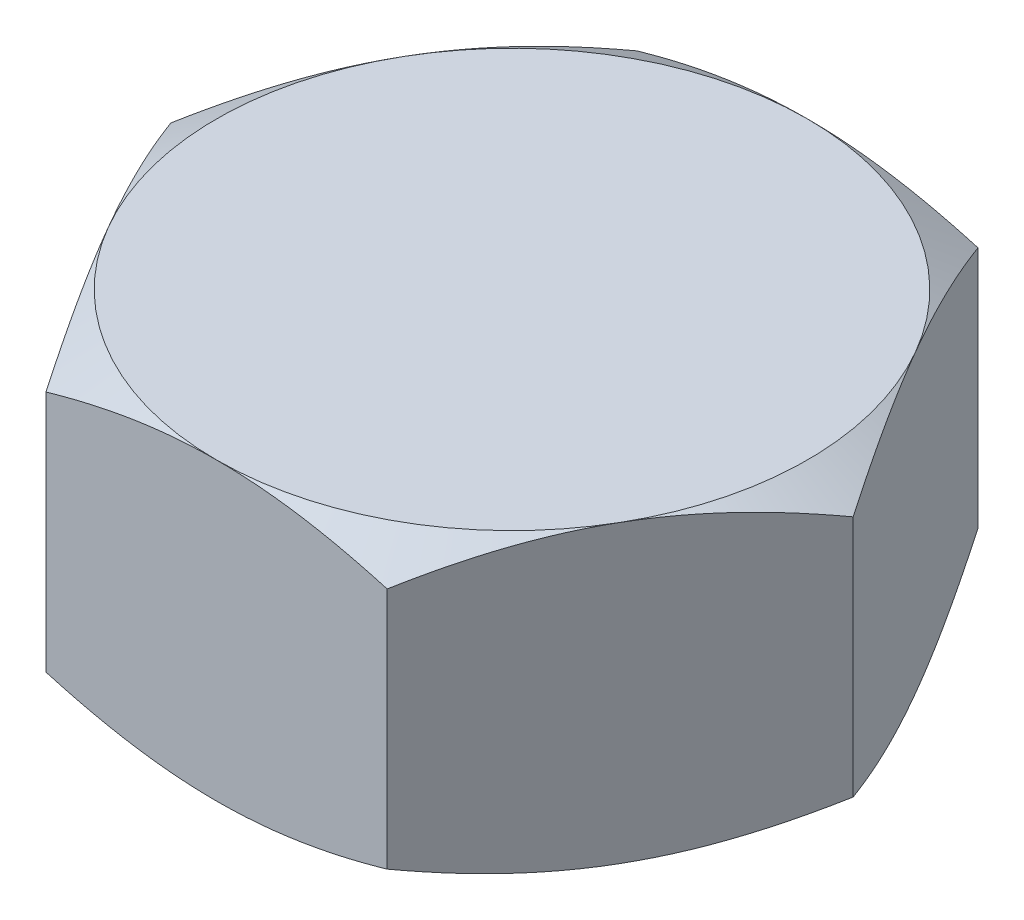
ISO-10303-21;
HEADER;
FILE_DESCRIPTION(('STEP AP214'),'2;1');
FILE_NAME('part.step','',(''),(''),'','','');
FILE_SCHEMA(('AUTOMOTIVE_DESIGN { 1 0 10303 214 1 1 1 1 }'));
ENDSEC;
DATA;
#1=APPLICATION_CONTEXT('core data for automotive mechanical design processes');
#2=APPLICATION_PROTOCOL_DEFINITION('international standard','automotive_design',2000,#1);
#3=PRODUCT_CONTEXT('',#1,'mechanical');
#4=PRODUCT('Part','Part','',(#3));
#5=PRODUCT_RELATED_PRODUCT_CATEGORY('part','',(#4));
#6=PRODUCT_DEFINITION_FORMATION('','',#4);
#7=PRODUCT_DEFINITION_CONTEXT('part definition',#1,'design');
#8=PRODUCT_DEFINITION('design','',#6,#7);
#9=PRODUCT_DEFINITION_SHAPE('','',#8);
#10=(LENGTH_UNIT() NAMED_UNIT(*) SI_UNIT(.MILLI.,.METRE.));
#11=(NAMED_UNIT(*) PLANE_ANGLE_UNIT() SI_UNIT($,.RADIAN.));
#12=(NAMED_UNIT(*) SI_UNIT($,.STERADIAN.) SOLID_ANGLE_UNIT());
#13=UNCERTAINTY_MEASURE_WITH_UNIT(LENGTH_MEASURE(1.E-05),#10,'distance_accuracy_value','');
#14=(GEOMETRIC_REPRESENTATION_CONTEXT(3) GLOBAL_UNCERTAINTY_ASSIGNED_CONTEXT((#13)) GLOBAL_UNIT_ASSIGNED_CONTEXT((#10,
#11,#12)) REPRESENTATION_CONTEXT('',''));
#15=CARTESIAN_POINT('',(0.,0.,0.));
#16=DIRECTION('',(0.,0.,1.));
#17=DIRECTION('',(1.,0.,0.));
#18=AXIS2_PLACEMENT_3D('',#15,#16,#17);
#19=CARTESIAN_POINT('',(2.88675134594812,2.5,5.00000000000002));
#20=DIRECTION('',(-0.866025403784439,0.,-0.499999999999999));
#21=DIRECTION('',(-0.499999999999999,0.,0.866025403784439));
#22=AXIS2_PLACEMENT_3D('',#19,#20,#21);
#23=PLANE('',#22);
#24=CARTESIAN_POINT('',(5.7736181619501,-2.05335134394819,-0.000200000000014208));
#25=CARTESIAN_POINT('',(5.64675433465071,-2.12661343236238,0.219534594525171));
#26=CARTESIAN_POINT('',(5.5188054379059,-2.19324867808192,0.441148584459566));
#27=CARTESIAN_POINT('',(5.26069210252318,-2.3095610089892,0.888213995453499));
#28=CARTESIAN_POINT('',(5.13052307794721,-2.35919695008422,1.11367335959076));
#29=CARTESIAN_POINT('',(4.87177839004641,-2.43644897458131,1.56183230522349));
#30=CARTESIAN_POINT('',(4.74324302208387,-2.46457962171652,1.78446209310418));
#31=CARTESIAN_POINT('',(4.54998783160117,-2.48980507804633,2.11918990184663));
#32=CARTESIAN_POINT('',(4.48552534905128,-2.49538654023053,2.23084219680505));
#33=CARTESIAN_POINT('',(4.35654081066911,-2.50079778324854,2.45424997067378));
#34=CARTESIAN_POINT('',(4.2920187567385,-2.50062774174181,2.5660054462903));
#35=CARTESIAN_POINT('',(4.11524635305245,-2.49224636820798,2.87218423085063));
#36=CARTESIAN_POINT('',(4.00305457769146,-2.47817022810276,3.0665060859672));
#37=CARTESIAN_POINT('',(3.77941563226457,-2.43353474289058,3.4538601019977));
#38=CARTESIAN_POINT('',(3.66796924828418,-2.40296013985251,3.64689090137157));
#39=CARTESIAN_POINT('',(3.44387972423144,-2.32653150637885,4.03502534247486));
#40=CARTESIAN_POINT('',(3.3312648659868,-2.28035362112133,4.23007999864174));
#41=CARTESIAN_POINT('',(3.1077146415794,-2.17554820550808,4.61728034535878));
#42=CARTESIAN_POINT('',(2.99677641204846,-2.11694529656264,4.8094309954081));
#43=CARTESIAN_POINT('',(2.88663587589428,-2.05335134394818,5.00020000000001));
#44=B_SPLINE_CURVE_WITH_KNOTS('',3,(#24,#25,#26,#27,#28,#29,#30,#31,#32,#33,#34,#35,#36,#37,#38,
#39,#40,#41,#42,#43),.UNSPECIFIED.,.F.,.F.,(4,2,2,2,2,2,2,2,2,4),(0.,0.792555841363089,
1.58701660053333,2.3618153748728,2.74884076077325,3.13585419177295,3.8096236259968,
4.4840172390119,5.17336882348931,5.86136694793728),.UNSPECIFIED.);
#45=CARTESIAN_POINT('',(5.77350269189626,-2.05341801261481,0.));
#46=VERTEX_POINT('',#45);
#47=CARTESIAN_POINT('',(4.33012701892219,-2.5,2.5));
#48=VERTEX_POINT('',#47);
#49=EDGE_CURVE('E47',#46,#48,#44,.T.);
#50=ORIENTED_EDGE('',*,*,#49,.F.);
#51=DIRECTION('',(0.,-1.,0.));
#52=VECTOR('',#51,1.);
#53=CARTESIAN_POINT('',(5.77350269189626,2.5,0.));
#54=LINE('',#53,#52);
#55=CARTESIAN_POINT('',(5.77350269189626,2.05341801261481,0.));
#56=VERTEX_POINT('',#55);
#57=EDGE_CURVE('E162',#56,#46,#54,.T.);
#58=ORIENTED_EDGE('',*,*,#57,.F.);
#59=CARTESIAN_POINT('',(2.88663587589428,2.05335134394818,5.00020000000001));
#60=CARTESIAN_POINT('',(3.01349970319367,2.12661343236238,4.78046540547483));
#61=CARTESIAN_POINT('',(3.14144859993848,2.19324867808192,4.55885141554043));
#62=CARTESIAN_POINT('',(3.3995619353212,2.3095610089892,4.1117860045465));
#63=CARTESIAN_POINT('',(3.52973095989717,2.35919695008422,3.88632664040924));
#64=CARTESIAN_POINT('',(3.78847564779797,2.43644897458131,3.4381676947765));
#65=CARTESIAN_POINT('',(3.91701101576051,2.46457962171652,3.21553790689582));
#66=CARTESIAN_POINT('',(4.11026620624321,2.48980507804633,2.88081009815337));
#67=CARTESIAN_POINT('',(4.1747286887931,2.49538654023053,2.76915780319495));
#68=CARTESIAN_POINT('',(4.30371322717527,2.50079778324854,2.54575002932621));
#69=CARTESIAN_POINT('',(4.36823528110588,2.50062774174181,2.4339945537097));
#70=CARTESIAN_POINT('',(4.54500768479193,2.49224636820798,2.12781576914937));
#71=CARTESIAN_POINT('',(4.65719946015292,2.47817022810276,1.93349391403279));
#72=CARTESIAN_POINT('',(4.88083840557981,2.43353474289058,1.5461398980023));
#73=CARTESIAN_POINT('',(4.9922847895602,2.40296013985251,1.35310909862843));
#74=CARTESIAN_POINT('',(5.21637431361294,2.32653150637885,0.964974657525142));
#75=CARTESIAN_POINT('',(5.32898917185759,2.28035362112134,0.769920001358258));
#76=CARTESIAN_POINT('',(5.55253939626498,2.17554820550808,0.382719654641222));
#77=CARTESIAN_POINT('',(5.66347762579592,2.11694529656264,0.190569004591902));
#78=CARTESIAN_POINT('',(5.7736181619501,2.05335134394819,-0.000200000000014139));
#79=B_SPLINE_CURVE_WITH_KNOTS('',3,(#59,#60,#61,#62,#63,#64,#65,#66,#67,#68,#69,#70,#71,#72,#73,
#74,#75,#76,#77,#78),.UNSPECIFIED.,.F.,.F.,(4,2,2,2,2,2,2,2,2,4),(0.,0.792555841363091,
1.58701660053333,2.36181537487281,2.74884076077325,3.13585419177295,3.8096236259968,
4.48401723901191,5.17336882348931,5.86136694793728),.UNSPECIFIED.);
#80=CARTESIAN_POINT('',(4.33012701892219,2.5,2.5));
#81=VERTEX_POINT('',#80);
#82=EDGE_CURVE('E244',#81,#56,#79,.T.);
#83=ORIENTED_EDGE('',*,*,#82,.F.);
#84=CARTESIAN_POINT('',(2.88675134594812,2.05341801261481,5.00000000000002));
#85=VERTEX_POINT('',#84);
#86=EDGE_CURVE('E254',#85,#81,#79,.T.);
#87=ORIENTED_EDGE('',*,*,#86,.F.);
#88=DIRECTION('',(0.,-1.,0.));
#89=VECTOR('',#88,1.);
#90=CARTESIAN_POINT('',(2.88675134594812,2.5,5.00000000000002));
#91=LINE('',#90,#89);
#92=CARTESIAN_POINT('',(2.88675134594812,-2.05341801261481,5.00000000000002));
#93=VERTEX_POINT('',#92);
#94=EDGE_CURVE('E149',#85,#93,#91,.T.);
#95=ORIENTED_EDGE('',*,*,#94,.T.);
#96=EDGE_CURVE('E141',#48,#93,#44,.T.);
#97=ORIENTED_EDGE('',*,*,#96,.F.);
#98=EDGE_LOOP('',(#50,#58,#83,#87,#95,#97));
#99=FACE_BOUND('',#98,.T.);
#100=ADVANCED_FACE('F31',(#99),#23,.F.);
#101=CARTESIAN_POINT('',(5.77350269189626,2.5,0.));
#102=DIRECTION('',(-0.866025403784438,0.,0.5));
#103=DIRECTION('',(0.5,0.,0.866025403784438));
#104=AXIS2_PLACEMENT_3D('',#101,#102,#103);
#105=PLANE('',#104);
#106=CARTESIAN_POINT('',(2.88663587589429,-2.05335134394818,-5.00020000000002));
#107=CARTESIAN_POINT('',(3.01349970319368,-2.12661343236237,-4.78046540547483));
#108=CARTESIAN_POINT('',(3.14144859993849,-2.19324867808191,-4.55885141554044));
#109=CARTESIAN_POINT('',(3.3995619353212,-2.3095610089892,-4.1117860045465));
#110=CARTESIAN_POINT('',(3.52973095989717,-2.35919695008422,-3.88632664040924));
#111=CARTESIAN_POINT('',(3.78847564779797,-2.43644897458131,-3.43816769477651));
#112=CARTESIAN_POINT('',(3.91701101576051,-2.46457962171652,-3.21553790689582));
#113=CARTESIAN_POINT('',(4.11026620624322,-2.48980507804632,-2.88081009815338));
#114=CARTESIAN_POINT('',(4.17472868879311,-2.49538654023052,-2.76915780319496));
#115=CARTESIAN_POINT('',(4.30371322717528,-2.50079778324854,-2.54575002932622));
#116=CARTESIAN_POINT('',(4.36823528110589,-2.5006277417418,-2.4339945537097));
#117=CARTESIAN_POINT('',(4.54500768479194,-2.49224636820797,-2.12781576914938));
#118=CARTESIAN_POINT('',(4.65719946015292,-2.47817022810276,-1.9334939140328));
#119=CARTESIAN_POINT('',(4.88083840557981,-2.43353474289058,-1.54613989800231));
#120=CARTESIAN_POINT('',(4.9922847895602,-2.4029601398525,-1.35310909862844));
#121=CARTESIAN_POINT('',(5.21637431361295,-2.32653150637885,-0.96497465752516));
#122=CARTESIAN_POINT('',(5.32898917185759,-2.28035362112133,-0.769920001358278));
#123=CARTESIAN_POINT('',(5.55253939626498,-2.17554820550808,-0.382719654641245));
#124=CARTESIAN_POINT('',(5.66347762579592,-2.11694529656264,-0.190569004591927));
#125=CARTESIAN_POINT('',(5.7736181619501,-2.05335134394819,0.000199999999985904));
#126=B_SPLINE_CURVE_WITH_KNOTS('',3,(#106,#107,#108,#109,#110,#111,#112,#113,#114,#115,#116,
#117,#118,#119,#120,#121,#122,#123,#124,#125),.UNSPECIFIED.,.F.,.F.,(4,2,2,2,2,2,2,2,2,4),(0.,
0.792555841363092,1.58701660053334,2.36181537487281,2.74884076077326,3.13585419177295,
3.8096236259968,4.4840172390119,5.17336882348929,5.86136694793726),.UNSPECIFIED.);
#127=CARTESIAN_POINT('',(2.88675134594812,-2.05341801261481,-5.00000000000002));
#128=VERTEX_POINT('',#127);
#129=CARTESIAN_POINT('',(4.3301270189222,-2.5,-2.5));
#130=VERTEX_POINT('',#129);
#131=EDGE_CURVE('E54',#128,#130,#126,.T.);
#132=ORIENTED_EDGE('',*,*,#131,.F.);
#133=DIRECTION('',(0.,-1.,0.));
#134=VECTOR('',#133,1.);
#135=CARTESIAN_POINT('',(2.88675134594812,2.5,-5.00000000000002));
#136=LINE('',#135,#134);
#137=CARTESIAN_POINT('',(2.88675134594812,2.05341801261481,-5.00000000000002));
#138=VERTEX_POINT('',#137);
#139=EDGE_CURVE('E159',#138,#128,#136,.T.);
#140=ORIENTED_EDGE('',*,*,#139,.F.);
#141=CARTESIAN_POINT('',(5.7736181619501,2.05335134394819,0.000199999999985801));
#142=CARTESIAN_POINT('',(5.64675433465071,2.12661343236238,-0.219534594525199));
#143=CARTESIAN_POINT('',(5.5188054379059,2.19324867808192,-0.441148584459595));
#144=CARTESIAN_POINT('',(5.26069210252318,2.3095610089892,-0.888213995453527));
#145=CARTESIAN_POINT('',(5.13052307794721,2.35919695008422,-1.11367335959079));
#146=CARTESIAN_POINT('',(4.87177839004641,2.43644897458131,-1.56183230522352));
#147=CARTESIAN_POINT('',(4.74324302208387,2.46457962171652,-1.7844620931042));
#148=CARTESIAN_POINT('',(4.54998783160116,2.48980507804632,-2.11918990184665));
#149=CARTESIAN_POINT('',(4.48552534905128,2.49538654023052,-2.23084219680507));
#150=CARTESIAN_POINT('',(4.35654081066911,2.50079778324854,-2.45424997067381));
#151=CARTESIAN_POINT('',(4.2920187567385,2.5006277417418,-2.56600544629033));
#152=CARTESIAN_POINT('',(4.11524635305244,2.49224636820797,-2.87218423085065));
#153=CARTESIAN_POINT('',(4.00305457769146,2.47817022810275,-3.06650608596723));
#154=CARTESIAN_POINT('',(3.77941563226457,2.43353474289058,-3.45386010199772));
#155=CARTESIAN_POINT('',(3.66796924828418,2.4029601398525,-3.64689090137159));
#156=CARTESIAN_POINT('',(3.44387972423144,2.32653150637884,-4.03502534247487));
#157=CARTESIAN_POINT('',(3.3312648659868,2.28035362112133,-4.23007999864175));
#158=CARTESIAN_POINT('',(3.1077146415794,2.17554820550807,-4.61728034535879));
#159=CARTESIAN_POINT('',(2.99677641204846,2.11694529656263,-4.80943099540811));
#160=CARTESIAN_POINT('',(2.88663587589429,2.05335134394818,-5.00020000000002));
#161=B_SPLINE_CURVE_WITH_KNOTS('',3,(#141,#142,#143,#144,#145,#146,#147,#148,#149,#150,#151,
#152,#153,#154,#155,#156,#157,#158,#159,#160),.UNSPECIFIED.,.F.,.F.,(4,2,2,2,2,2,2,2,2,4),(0.,
0.79255584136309,1.58701660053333,2.3618153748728,2.74884076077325,3.13585419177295,
3.80962362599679,4.48401723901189,5.17336882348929,5.86136694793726),.UNSPECIFIED.);
#162=CARTESIAN_POINT('',(4.3301270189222,2.5,-2.5));
#163=VERTEX_POINT('',#162);
#164=EDGE_CURVE('E253',#163,#138,#161,.T.);
#165=ORIENTED_EDGE('',*,*,#164,.F.);
#166=EDGE_CURVE('E249',#56,#163,#161,.T.);
#167=ORIENTED_EDGE('',*,*,#166,.F.);
#168=ORIENTED_EDGE('',*,*,#57,.T.);
#169=EDGE_CURVE('E266',#130,#46,#126,.T.);
#170=ORIENTED_EDGE('',*,*,#169,.F.);
#171=EDGE_LOOP('',(#132,#140,#165,#167,#168,#170));
#172=FACE_BOUND('',#171,.T.);
#173=ADVANCED_FACE('F255',(#172),#105,.F.);
#174=CARTESIAN_POINT('',(2.88675134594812,2.5,-5.00000000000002));
#175=DIRECTION('',(0.,0.,1.));
#176=DIRECTION('',(1.,0.,0.));
#177=AXIS2_PLACEMENT_3D('',#174,#175,#176);
#178=PLANE('',#177);
#179=CARTESIAN_POINT('',(-7.83582824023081,-0.0201818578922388,-5.00000000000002));
#180=CARTESIAN_POINT('',(-7.61675258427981,-0.126778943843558,-5.00000000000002));
#181=CARTESIAN_POINT('',(-7.39718272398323,-0.232377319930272,-5.00000000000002));
#182=CARTESIAN_POINT('',(-6.9567920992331,-0.441016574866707,-5.00000000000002));
#183=CARTESIAN_POINT('',(-6.73597115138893,-0.544057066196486,-5.00000000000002));
#184=CARTESIAN_POINT('',(-6.29171673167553,-0.74752156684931,-5.00000000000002));
#185=CARTESIAN_POINT('',(-6.06827562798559,-0.84792896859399,-5.00000000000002));
#186=CARTESIAN_POINT('',(-5.61964466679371,-1.04474266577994,-5.00000000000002));
#187=CARTESIAN_POINT('',(-5.39445489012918,-1.14114914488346,-5.00000000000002));
#188=CARTESIAN_POINT('',(-4.93438073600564,-1.33205603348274,-5.00000000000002));
#189=CARTESIAN_POINT('',(-4.69942447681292,-1.42638413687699,-5.00000000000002));
#190=CARTESIAN_POINT('',(-4.2267933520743,-1.60809698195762,-5.00000000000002));
#191=CARTESIAN_POINT('',(-3.98911818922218,-1.69548095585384,-5.00000000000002));
#192=CARTESIAN_POINT('',(-3.51109032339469,-1.86107114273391,-5.00000000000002));
#193=CARTESIAN_POINT('',(-3.27074388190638,-1.9392952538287,-5.00000000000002));
#194=CARTESIAN_POINT('',(-2.7866038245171,-2.08410963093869,-5.00000000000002));
#195=CARTESIAN_POINT('',(-2.54281129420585,-2.15070347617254,-5.00000000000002));
#196=CARTESIAN_POINT('',(-2.05301710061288,-2.26875493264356,-5.00000000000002));
#197=CARTESIAN_POINT('',(-1.80703640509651,-2.32029796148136,-5.00000000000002));
#198=CARTESIAN_POINT('',(-1.31193168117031,-2.40539626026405,-5.00000000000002));
#199=CARTESIAN_POINT('',(-1.06280797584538,-2.43895336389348,-5.00000000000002));
#200=CARTESIAN_POINT('',(-0.56594836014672,-2.48496717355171,-5.00000000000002));
#201=CARTESIAN_POINT('',(-0.318238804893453,-2.49770143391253,-5.00000000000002));
#202=CARTESIAN_POINT('',(0.177377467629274,-2.50172580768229,-5.00000000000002));
#203=CARTESIAN_POINT('',(0.425284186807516,-2.49301571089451,-5.00000000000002));
#204=CARTESIAN_POINT('',(0.843772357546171,-2.46083600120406,-5.00000000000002));
#205=CARTESIAN_POINT('',(1.01479089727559,-2.44270146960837,-5.00000000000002));
#206=CARTESIAN_POINT('',(1.3556215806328,-2.39731277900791,-5.00000000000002));
#207=CARTESIAN_POINT('',(1.52543356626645,-2.37005744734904,-5.00000000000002));
#208=CARTESIAN_POINT('',(2.0328088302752,-2.27603792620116,-5.00000000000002));
#209=CARTESIAN_POINT('',(2.36813213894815,-2.19703587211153,-5.00000000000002));
#210=CARTESIAN_POINT('',(2.8696327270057,-2.05946652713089,-5.00000000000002));
#211=CARTESIAN_POINT('',(3.03839424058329,-2.0097781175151,-5.00000000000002));
#212=CARTESIAN_POINT('',(3.37427940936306,-1.90509537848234,-5.00000000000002));
#213=CARTESIAN_POINT('',(3.54140305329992,-1.85010101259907,-5.00000000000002));
#214=CARTESIAN_POINT('',(3.87406252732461,-1.7357008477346,-5.00000000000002));
#215=CARTESIAN_POINT('',(4.0395988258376,-1.67629639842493,-5.00000000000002));
#216=CARTESIAN_POINT('',(4.36929036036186,-1.55378935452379,-5.00000000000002));
#217=CARTESIAN_POINT('',(4.53344561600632,-1.49068681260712,-5.00000000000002));
#218=CARTESIAN_POINT('',(4.93359002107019,-1.33251408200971,-5.00000000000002));
#219=CARTESIAN_POINT('',(5.16891080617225,-1.23575576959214,-5.00000000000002));
#220=CARTESIAN_POINT('',(5.63743106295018,-1.0372170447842,-5.00000000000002));
#221=CARTESIAN_POINT('',(5.87063037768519,-0.935436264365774,-5.00000000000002));
#222=CARTESIAN_POINT('',(6.33531777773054,-0.72790414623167,-5.00000000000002));
#223=CARTESIAN_POINT('',(6.56680543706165,-0.62215185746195,-5.00000000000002));
#224=CARTESIAN_POINT('',(7.02832278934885,-0.407506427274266,-5.00000000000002));
#225=CARTESIAN_POINT('',(7.2583524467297,-0.298613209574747,-5.00000000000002));
#226=CARTESIAN_POINT('',(7.71747583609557,-0.0781683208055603,-5.00000000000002));
#227=CARTESIAN_POINT('',(7.94656809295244,0.0333864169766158,-5.00000000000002));
#228=CARTESIAN_POINT('',(8.40373705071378,0.258559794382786,-5.00000000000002));
#229=CARTESIAN_POINT('',(8.63181374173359,0.372178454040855,-5.00000000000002));
#230=CARTESIAN_POINT('',(9.31470112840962,0.715524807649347,-5.00000000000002));
#231=CARTESIAN_POINT('',(9.76824174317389,0.947778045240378,-5.00000000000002));
#232=CARTESIAN_POINT('',(10.6324695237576,1.395993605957,-5.00000000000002));
#233=CARTESIAN_POINT('',(11.0433644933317,1.61155711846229,-5.00000000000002));
#234=CARTESIAN_POINT('',(11.8636388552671,2.0455881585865,-5.00000000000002));
#235=CARTESIAN_POINT('',(12.2730181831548,2.26405580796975,-5.00000000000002));
#236=CARTESIAN_POINT('',(13.0894643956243,2.70257621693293,-5.00000000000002));
#237=CARTESIAN_POINT('',(13.4965345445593,2.92262290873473,-5.00000000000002));
#238=CARTESIAN_POINT('',(14.309713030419,3.36442738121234,-5.00000000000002));
#239=CARTESIAN_POINT('',(14.7158214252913,3.58618505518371,-5.00000000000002));
#240=CARTESIAN_POINT('',(15.1215799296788,3.8085768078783,-5.00000000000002));
#241=B_SPLINE_CURVE_WITH_KNOTS('',3,(#179,#180,#181,#182,#183,#184,#185,#186,#187,#188,#189,
#190,#191,#192,#193,#194,#195,#196,#197,#198,#199,#200,#201,#202,#203,#204,#205,#206,#207,#208,
#209,#210,#211,#212,#213,#214,#215,#216,#217,#218,#219,#220,#221,#222,#223,#224,#225,#226,#227,
#228,#229,#230,#231,#232,#233,#234,#235,#236,#237,#238,#239,#240),.UNSPECIFIED.,.F.,.F.,(4,2,2,
2,2,2,2,2,2,2,2,2,2,2,2,2,2,2,2,2,2,2,2,2,2,2,2,2,2,2,4),(0.,0.73090780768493,1.46192568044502,
2.1967875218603,2.9316155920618,3.69108328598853,4.4506348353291,5.20867656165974,
5.96648458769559,6.71990430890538,7.47324720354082,8.21646418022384,8.95968844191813,
9.47537174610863,9.99112137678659,11.0231580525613,11.5508843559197,12.0786142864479,
12.6061833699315,13.1337449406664,13.8969744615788,14.6602599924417,15.4237294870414,
16.1872175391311,16.9516324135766,17.7160547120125,19.244657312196,20.6366654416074,
22.0287321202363,23.4169424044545,24.8050668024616),.UNSPECIFIED.);
#242=CARTESIAN_POINT('',(-2.88675134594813,-2.0534180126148,-5.00000000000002));
#243=VERTEX_POINT('',#242);
#244=CARTESIAN_POINT('',(0.,-2.5,-5.00000000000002));
#245=VERTEX_POINT('',#244);
#246=EDGE_CURVE('E268',#243,#245,#241,.T.);
#247=ORIENTED_EDGE('',*,*,#246,.F.);
#248=DIRECTION('',(0.,-1.,0.));
#249=VECTOR('',#248,1.);
#250=CARTESIAN_POINT('',(-2.88675134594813,2.5,-5.00000000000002));
#251=LINE('',#250,#249);
#252=CARTESIAN_POINT('',(-2.88675134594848,2.05341801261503,-5.00000000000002));
#253=VERTEX_POINT('',#252);
#254=EDGE_CURVE('E151',#253,#243,#251,.T.);
#255=ORIENTED_EDGE('',*,*,#254,.F.);
#256=CARTESIAN_POINT('',(-7.83582824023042,0.0201818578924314,-5.00000000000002));
#257=CARTESIAN_POINT('',(-7.61675258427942,0.126778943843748,-5.00000000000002));
#258=CARTESIAN_POINT('',(-7.39718272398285,0.232377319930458,-5.00000000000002));
#259=CARTESIAN_POINT('',(-6.95679209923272,0.441016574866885,-5.00000000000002));
#260=CARTESIAN_POINT('',(-6.73597115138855,0.54405706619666,-5.00000000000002));
#261=CARTESIAN_POINT('',(-6.29171673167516,0.747521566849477,-5.00000000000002));
#262=CARTESIAN_POINT('',(-6.06827562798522,0.847928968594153,-5.00000000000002));
#263=CARTESIAN_POINT('',(-5.61964466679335,1.04474266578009,-5.00000000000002));
#264=CARTESIAN_POINT('',(-5.39445489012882,1.14114914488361,-5.00000000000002));
#265=CARTESIAN_POINT('',(-4.93438073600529,1.33205603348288,-5.00000000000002));
#266=CARTESIAN_POINT('',(-4.69942447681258,1.42638413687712,-5.00000000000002));
#267=CARTESIAN_POINT('',(-4.22679335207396,1.60809698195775,-5.00000000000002));
#268=CARTESIAN_POINT('',(-3.98911818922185,1.69548095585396,-5.00000000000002));
#269=CARTESIAN_POINT('',(-3.51109032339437,1.86107114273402,-5.00000000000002));
#270=CARTESIAN_POINT('',(-3.27074388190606,1.93929525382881,-5.00000000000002));
#271=CARTESIAN_POINT('',(-2.78660382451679,2.08410963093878,-5.00000000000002));
#272=CARTESIAN_POINT('',(-2.54281129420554,2.15070347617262,-5.00000000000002));
#273=CARTESIAN_POINT('',(-2.05301710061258,2.26875493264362,-5.00000000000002));
#274=CARTESIAN_POINT('',(-1.80703640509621,2.32029796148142,-5.00000000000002));
#275=CARTESIAN_POINT('',(-1.31193168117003,2.40539626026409,-5.00000000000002));
#276=CARTESIAN_POINT('',(-1.0628079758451,2.43895336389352,-5.00000000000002));
#277=CARTESIAN_POINT('',(-0.565948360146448,2.48496717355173,-5.00000000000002));
#278=CARTESIAN_POINT('',(-0.318238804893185,2.49770143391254,-5.00000000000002));
#279=CARTESIAN_POINT('',(0.177377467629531,2.50172580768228,-5.00000000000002));
#280=CARTESIAN_POINT('',(0.425284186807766,2.4930157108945,-5.00000000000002));
#281=CARTESIAN_POINT('',(0.843772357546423,2.46083600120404,-5.00000000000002));
#282=CARTESIAN_POINT('',(1.01479089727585,2.44270146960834,-5.00000000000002));
#283=CARTESIAN_POINT('',(1.35562158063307,2.39731277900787,-5.00000000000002));
#284=CARTESIAN_POINT('',(1.52543356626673,2.37005744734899,-5.00000000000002));
#285=CARTESIAN_POINT('',(2.0328088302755,2.2760379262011,-5.00000000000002));
#286=CARTESIAN_POINT('',(2.36813213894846,2.19703587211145,-5.00000000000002));
#287=CARTESIAN_POINT('',(2.86963272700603,2.05946652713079,-5.00000000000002));
#288=CARTESIAN_POINT('',(3.03839424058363,2.00977811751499,-5.00000000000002));
#289=CARTESIAN_POINT('',(3.37427940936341,1.90509537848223,-5.00000000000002));
#290=CARTESIAN_POINT('',(3.54140305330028,1.85010101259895,-5.00000000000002));
#291=CARTESIAN_POINT('',(3.87406252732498,1.73570084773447,-5.00000000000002));
#292=CARTESIAN_POINT('',(4.03959882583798,1.67629639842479,-5.00000000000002));
#293=CARTESIAN_POINT('',(4.36929036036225,1.55378935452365,-5.00000000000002));
#294=CARTESIAN_POINT('',(4.53344561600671,1.49068681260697,-5.00000000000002));
#295=CARTESIAN_POINT('',(4.93359002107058,1.33251408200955,-5.00000000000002));
#296=CARTESIAN_POINT('',(5.16891080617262,1.23575576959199,-5.00000000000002));
#297=CARTESIAN_POINT('',(5.63743106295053,1.03721704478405,-5.00000000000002));
#298=CARTESIAN_POINT('',(5.87063037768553,0.935436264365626,-5.00000000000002));
#299=CARTESIAN_POINT('',(6.33531777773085,0.727904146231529,-5.00000000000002));
#300=CARTESIAN_POINT('',(6.56680543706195,0.622151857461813,-5.00000000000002));
#301=CARTESIAN_POINT('',(7.02832278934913,0.407506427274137,-5.00000000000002));
#302=CARTESIAN_POINT('',(7.25835244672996,0.298613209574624,-5.00000000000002));
#303=CARTESIAN_POINT('',(7.71747583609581,0.0781683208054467,-5.00000000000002));
#304=CARTESIAN_POINT('',(7.94656809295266,-0.0333864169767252,-5.00000000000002));
#305=CARTESIAN_POINT('',(8.40373705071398,-0.258559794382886,-5.00000000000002));
#306=CARTESIAN_POINT('',(8.63181374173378,-0.372178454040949,-5.00000000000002));
#307=CARTESIAN_POINT('',(9.31470112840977,-0.715524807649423,-5.00000000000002));
#308=CARTESIAN_POINT('',(9.76824174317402,-0.947778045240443,-5.00000000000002));
#309=CARTESIAN_POINT('',(10.6324695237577,-1.39599360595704,-5.00000000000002));
#310=CARTESIAN_POINT('',(11.0433644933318,-1.61155711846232,-5.00000000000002));
#311=CARTESIAN_POINT('',(11.8636388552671,-2.04558815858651,-5.00000000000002));
#312=CARTESIAN_POINT('',(12.2730181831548,-2.26405580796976,-5.00000000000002));
#313=CARTESIAN_POINT('',(13.0894643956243,-2.70257621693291,-5.00000000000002));
#314=CARTESIAN_POINT('',(13.4965345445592,-2.92262290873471,-5.00000000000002));
#315=CARTESIAN_POINT('',(14.3097130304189,-3.36442738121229,-5.00000000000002));
#316=CARTESIAN_POINT('',(14.7158214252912,-3.58618505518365,-5.00000000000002));
#317=CARTESIAN_POINT('',(15.1215799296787,-3.80857680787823,-5.00000000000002));
#318=B_SPLINE_CURVE_WITH_KNOTS('',3,(#256,#257,#258,#259,#260,#261,#262,#263,#264,#265,#266,
#267,#268,#269,#270,#271,#272,#273,#274,#275,#276,#277,#278,#279,#280,#281,#282,#283,#284,#285,
#286,#287,#288,#289,#290,#291,#292,#293,#294,#295,#296,#297,#298,#299,#300,#301,#302,#303,#304,
#305,#306,#307,#308,#309,#310,#311,#312,#313,#314,#315,#316,#317),.UNSPECIFIED.,.F.,.F.,(4,2,2,
2,2,2,2,2,2,2,2,2,2,2,2,2,2,2,2,2,2,2,2,2,2,2,2,2,2,2,4),(0.,0.730907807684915,1.46192568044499,
2.19678752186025,2.93161559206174,3.69108328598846,4.450634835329,5.20867656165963,
5.96648458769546,6.71990430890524,7.47324720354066,8.21646418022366,8.95968844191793,
9.47537174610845,9.99112137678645,11.0231580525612,11.5508843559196,12.0786142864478,
12.6061833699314,13.1337449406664,13.8969744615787,14.6602599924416,15.4237294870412,
16.187217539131,16.9516324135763,17.7160547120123,19.2446573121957,20.636665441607,
22.0287321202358,23.416942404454,24.805066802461),.UNSPECIFIED.);
#319=CARTESIAN_POINT('',(0.,2.5,-5.00000000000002));
#320=VERTEX_POINT('',#319);
#321=EDGE_CURVE('E202',#320,#253,#318,.F.);
#322=ORIENTED_EDGE('',*,*,#321,.F.);
#323=EDGE_CURVE('E209',#138,#320,#318,.F.);
#324=ORIENTED_EDGE('',*,*,#323,.F.);
#325=ORIENTED_EDGE('',*,*,#139,.T.);
#326=EDGE_CURVE('E267',#245,#128,#241,.T.);
#327=ORIENTED_EDGE('',*,*,#326,.F.);
#328=EDGE_LOOP('',(#247,#255,#322,#324,#325,#327));
#329=FACE_BOUND('',#328,.T.);
#330=ADVANCED_FACE('F258',(#329),#178,.F.);
#331=CARTESIAN_POINT('',(-2.88675134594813,2.5,-5.00000000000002));
#332=DIRECTION('',(0.866025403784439,0.,0.5));
#333=DIRECTION('',(0.5,0.,-0.866025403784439));
#334=AXIS2_PLACEMENT_3D('',#331,#332,#333);
#335=PLANE('',#334);
#336=CARTESIAN_POINT('',(-5.77361816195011,-2.05335134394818,0.000199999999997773));
#337=CARTESIAN_POINT('',(-5.64675433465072,-2.12661343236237,-0.219534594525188));
#338=CARTESIAN_POINT('',(-5.51880543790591,-2.19324867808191,-0.441148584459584));
#339=CARTESIAN_POINT('',(-5.26069210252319,-2.30956100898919,-0.888213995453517));
#340=CARTESIAN_POINT('',(-5.13052307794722,-2.35919695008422,-1.11367335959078));
#341=CARTESIAN_POINT('',(-4.87177839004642,-2.43644897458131,-1.56183230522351));
#342=CARTESIAN_POINT('',(-4.74324302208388,-2.46457962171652,-1.7844620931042));
#343=CARTESIAN_POINT('',(-4.54998783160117,-2.48980507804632,-2.11918990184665));
#344=CARTESIAN_POINT('',(-4.48552534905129,-2.49538654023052,-2.23084219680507));
#345=CARTESIAN_POINT('',(-4.35654081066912,-2.50079778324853,-2.4542499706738));
#346=CARTESIAN_POINT('',(-4.29201875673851,-2.5006277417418,-2.56600544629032));
#347=CARTESIAN_POINT('',(-4.11524635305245,-2.49224636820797,-2.87218423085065));
#348=CARTESIAN_POINT('',(-4.00305457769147,-2.47817022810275,-3.06650608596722));
#349=CARTESIAN_POINT('',(-3.77941563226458,-2.43353474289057,-3.45386010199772));
#350=CARTESIAN_POINT('',(-3.66796924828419,-2.4029601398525,-3.64689090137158));
#351=CARTESIAN_POINT('',(-3.44387972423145,-2.32653150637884,-4.03502534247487));
#352=CARTESIAN_POINT('',(-3.33126486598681,-2.28035362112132,-4.23007999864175));
#353=CARTESIAN_POINT('',(-3.10771464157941,-2.17554820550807,-4.61728034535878));
#354=CARTESIAN_POINT('',(-2.99677641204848,-2.11694529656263,-4.8094309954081));
#355=CARTESIAN_POINT('',(-2.8866358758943,-2.05335134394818,-5.00020000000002));
#356=B_SPLINE_CURVE_WITH_KNOTS('',3,(#336,#337,#338,#339,#340,#341,#342,#343,#344,#345,#346,
#347,#348,#349,#350,#351,#352,#353,#354,#355),.UNSPECIFIED.,.F.,.F.,(4,2,2,2,2,2,2,2,2,4),(0.,
0.792555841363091,1.58701660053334,2.36181537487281,2.74884076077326,3.13585419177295,
3.8096236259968,4.4840172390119,5.1733688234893,5.86136694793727),.UNSPECIFIED.);
#357=CARTESIAN_POINT('',(-5.77350269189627,-2.05341801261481,0.));
#358=VERTEX_POINT('',#357);
#359=CARTESIAN_POINT('',(-4.3301270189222,-2.5,-2.5));
#360=VERTEX_POINT('',#359);
#361=EDGE_CURVE('E274',#358,#360,#356,.T.);
#362=ORIENTED_EDGE('',*,*,#361,.F.);
#363=DIRECTION('',(0.,-1.,0.));
#364=VECTOR('',#363,1.);
#365=CARTESIAN_POINT('',(-5.77350269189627,2.5,0.));
#366=LINE('',#365,#364);
#367=CARTESIAN_POINT('',(-5.77350269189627,2.05341801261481,0.));
#368=VERTEX_POINT('',#367);
#369=EDGE_CURVE('E148',#368,#358,#366,.T.);
#370=ORIENTED_EDGE('',*,*,#369,.F.);
#371=CARTESIAN_POINT('',(-2.8866358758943,2.05335134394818,-5.00020000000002));
#372=CARTESIAN_POINT('',(-3.01349970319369,2.12661343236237,-4.78046540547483));
#373=CARTESIAN_POINT('',(-3.1414485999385,2.19324867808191,-4.55885141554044));
#374=CARTESIAN_POINT('',(-3.39956193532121,2.30956100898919,-4.1117860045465));
#375=CARTESIAN_POINT('',(-3.52973095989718,2.35919695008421,-3.88632664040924));
#376=CARTESIAN_POINT('',(-3.78847564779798,2.43644897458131,-3.4381676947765));
#377=CARTESIAN_POINT('',(-3.91701101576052,2.46457962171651,-3.21553790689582));
#378=CARTESIAN_POINT('',(-4.11026620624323,2.48980507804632,-2.88081009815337));
#379=CARTESIAN_POINT('',(-4.17472868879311,2.49538654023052,-2.76915780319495));
#380=CARTESIAN_POINT('',(-4.30371322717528,2.50079778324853,-2.54575002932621));
#381=CARTESIAN_POINT('',(-4.3682352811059,2.5006277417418,-2.4339945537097));
#382=CARTESIAN_POINT('',(-4.54500768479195,2.49224636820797,-2.12781576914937));
#383=CARTESIAN_POINT('',(-4.65719946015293,2.47817022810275,-1.9334939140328));
#384=CARTESIAN_POINT('',(-4.88083840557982,2.43353474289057,-1.5461398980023));
#385=CARTESIAN_POINT('',(-4.99228478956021,2.4029601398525,-1.35310909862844));
#386=CARTESIAN_POINT('',(-5.21637431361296,2.32653150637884,-0.964974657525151));
#387=CARTESIAN_POINT('',(-5.3289891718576,2.28035362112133,-0.769920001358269));
#388=CARTESIAN_POINT('',(-5.55253939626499,2.17554820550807,-0.382719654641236));
#389=CARTESIAN_POINT('',(-5.66347762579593,2.11694529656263,-0.190569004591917));
#390=CARTESIAN_POINT('',(-5.77361816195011,2.05335134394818,0.000199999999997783));
#391=B_SPLINE_CURVE_WITH_KNOTS('',3,(#371,#372,#373,#374,#375,#376,#377,#378,#379,#380,#381,
#382,#383,#384,#385,#386,#387,#388,#389,#390),.UNSPECIFIED.,.F.,.F.,(4,2,2,2,2,2,2,2,2,4),(0.,
0.792555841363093,1.58701660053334,2.36181537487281,2.74884076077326,3.13585419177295,
3.8096236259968,4.4840172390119,5.1733688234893,5.86136694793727),.UNSPECIFIED.);
#392=CARTESIAN_POINT('',(-4.3301270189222,2.5,-2.5));
#393=VERTEX_POINT('',#392);
#394=EDGE_CURVE('E192',#393,#368,#391,.T.);
#395=ORIENTED_EDGE('',*,*,#394,.F.);
#396=EDGE_CURVE('E195',#253,#393,#391,.T.);
#397=ORIENTED_EDGE('',*,*,#396,.F.);
#398=ORIENTED_EDGE('',*,*,#254,.T.);
#399=EDGE_CURVE('E273',#360,#243,#356,.T.);
#400=ORIENTED_EDGE('',*,*,#399,.F.);
#401=EDGE_LOOP('',(#362,#370,#395,#397,#398,#400));
#402=FACE_BOUND('',#401,.T.);
#403=ADVANCED_FACE('F194',(#402),#335,.F.);
#404=CARTESIAN_POINT('',(-5.77350269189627,2.5,0.));
#405=DIRECTION('',(0.866025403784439,0.,-0.5));
#406=DIRECTION('',(-0.5,0.,-0.866025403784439));
#407=AXIS2_PLACEMENT_3D('',#404,#405,#406);
#408=PLANE('',#407);
#409=CARTESIAN_POINT('',(-2.88663587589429,-2.05335134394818,5.00020000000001));
#410=CARTESIAN_POINT('',(-3.01349970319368,-2.12661343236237,4.78046540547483));
#411=CARTESIAN_POINT('',(-3.14144859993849,-2.19324867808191,4.55885141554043));
#412=CARTESIAN_POINT('',(-3.39956193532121,-2.3095610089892,4.1117860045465));
#413=CARTESIAN_POINT('',(-3.52973095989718,-2.35919695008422,3.88632664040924));
#414=CARTESIAN_POINT('',(-3.78847564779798,-2.43644897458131,3.4381676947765));
#415=CARTESIAN_POINT('',(-3.91701101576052,-2.46457962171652,3.21553790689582));
#416=CARTESIAN_POINT('',(-4.11026620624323,-2.48980507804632,2.88081009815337));
#417=CARTESIAN_POINT('',(-4.17472868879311,-2.49538654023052,2.76915780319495));
#418=CARTESIAN_POINT('',(-4.30371322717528,-2.50079778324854,2.54575002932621));
#419=CARTESIAN_POINT('',(-4.36823528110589,-2.5006277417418,2.4339945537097));
#420=CARTESIAN_POINT('',(-4.54500768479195,-2.49224636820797,2.12781576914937));
#421=CARTESIAN_POINT('',(-4.65719946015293,-2.47817022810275,1.9334939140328));
#422=CARTESIAN_POINT('',(-4.88083840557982,-2.43353474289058,1.5461398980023));
#423=CARTESIAN_POINT('',(-4.99228478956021,-2.4029601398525,1.35310909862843));
#424=CARTESIAN_POINT('',(-5.21637431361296,-2.32653150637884,0.964974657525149));
#425=CARTESIAN_POINT('',(-5.3289891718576,-2.28035362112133,0.769920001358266));
#426=CARTESIAN_POINT('',(-5.55253939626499,-2.17554820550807,0.382719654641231));
#427=CARTESIAN_POINT('',(-5.66347762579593,-2.11694529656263,0.190569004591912));
#428=CARTESIAN_POINT('',(-5.77361816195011,-2.05335134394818,-0.000200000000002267));
#429=B_SPLINE_CURVE_WITH_KNOTS('',3,(#409,#410,#411,#412,#413,#414,#415,#416,#417,#418,#419,
#420,#421,#422,#423,#424,#425,#426,#427,#428),.UNSPECIFIED.,.F.,.F.,(4,2,2,2,2,2,2,2,2,4),(0.,
0.792555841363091,1.58701660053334,2.36181537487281,2.74884076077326,3.13585419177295,
3.8096236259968,4.4840172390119,5.1733688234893,5.86136694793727),.UNSPECIFIED.);
#430=CARTESIAN_POINT('',(-2.88675134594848,-2.05341801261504,5.00000000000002));
#431=VERTEX_POINT('',#430);
#432=CARTESIAN_POINT('',(-4.3301270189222,-2.5,2.5));
#433=VERTEX_POINT('',#432);
#434=EDGE_CURVE('E125',#431,#433,#429,.T.);
#435=ORIENTED_EDGE('',*,*,#434,.F.);
#436=DIRECTION('',(0.,-1.,0.));
#437=VECTOR('',#436,1.);
#438=CARTESIAN_POINT('',(-2.88675134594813,2.5,5.00000000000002));
#439=LINE('',#438,#437);
#440=CARTESIAN_POINT('',(-2.88675134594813,2.0534180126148,5.00000000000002));
#441=VERTEX_POINT('',#440);
#442=EDGE_CURVE('E138',#441,#431,#439,.T.);
#443=ORIENTED_EDGE('',*,*,#442,.F.);
#444=CARTESIAN_POINT('',(-5.77361816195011,2.05335134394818,-0.000200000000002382));
#445=CARTESIAN_POINT('',(-5.64675433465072,2.12661343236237,0.219534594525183));
#446=CARTESIAN_POINT('',(-5.51880543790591,2.19324867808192,0.441148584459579));
#447=CARTESIAN_POINT('',(-5.26069210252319,2.3095610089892,0.888213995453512));
#448=CARTESIAN_POINT('',(-5.13052307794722,2.35919695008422,1.11367335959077));
#449=CARTESIAN_POINT('',(-4.87177839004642,2.43644897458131,1.56183230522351));
#450=CARTESIAN_POINT('',(-4.74324302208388,2.46457962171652,1.78446209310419));
#451=CARTESIAN_POINT('',(-4.54998783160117,2.48980507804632,2.11918990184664));
#452=CARTESIAN_POINT('',(-4.48552534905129,2.49538654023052,2.23084219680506));
#453=CARTESIAN_POINT('',(-4.35654081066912,2.50079778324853,2.4542499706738));
#454=CARTESIAN_POINT('',(-4.29201875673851,2.5006277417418,2.56600544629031));
#455=CARTESIAN_POINT('',(-4.11524635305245,2.49224636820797,2.87218423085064));
#456=CARTESIAN_POINT('',(-4.00305457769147,2.47817022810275,3.06650608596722));
#457=CARTESIAN_POINT('',(-3.77941563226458,2.43353474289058,3.45386010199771));
#458=CARTESIAN_POINT('',(-3.66796924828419,2.4029601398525,3.64689090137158));
#459=CARTESIAN_POINT('',(-3.44387972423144,2.32653150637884,4.03502534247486));
#460=CARTESIAN_POINT('',(-3.33126486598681,2.28035362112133,4.23007999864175));
#461=CARTESIAN_POINT('',(-3.10771464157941,2.17554820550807,4.61728034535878));
#462=CARTESIAN_POINT('',(-2.99677641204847,2.11694529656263,4.8094309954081));
#463=CARTESIAN_POINT('',(-2.88663587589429,2.05335134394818,5.00020000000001));
#464=B_SPLINE_CURVE_WITH_KNOTS('',3,(#444,#445,#446,#447,#448,#449,#450,#451,#452,#453,#454,
#455,#456,#457,#458,#459,#460,#461,#462,#463),.UNSPECIFIED.,.F.,.F.,(4,2,2,2,2,2,2,2,2,4),(0.,
0.792555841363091,1.58701660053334,2.36181537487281,2.74884076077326,3.13585419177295,
3.8096236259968,4.4840172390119,5.1733688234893,5.86136694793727),.UNSPECIFIED.);
#465=CARTESIAN_POINT('',(-4.3301270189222,2.5,2.5));
#466=VERTEX_POINT('',#465);
#467=EDGE_CURVE('E201',#466,#441,#464,.T.);
#468=ORIENTED_EDGE('',*,*,#467,.F.);
#469=EDGE_CURVE('E199',#368,#466,#464,.T.);
#470=ORIENTED_EDGE('',*,*,#469,.F.);
#471=ORIENTED_EDGE('',*,*,#369,.T.);
#472=EDGE_CURVE('E140',#433,#358,#429,.T.);
#473=ORIENTED_EDGE('',*,*,#472,.F.);
#474=EDGE_LOOP('',(#435,#443,#468,#470,#471,#473));
#475=FACE_BOUND('',#474,.T.);
#476=ADVANCED_FACE('F136',(#475),#408,.F.);
#477=CARTESIAN_POINT('',(-2.88675134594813,2.5,5.00000000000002));
#478=DIRECTION('',(0.,0.,-1.));
#479=DIRECTION('',(-1.,0.,0.));
#480=AXIS2_PLACEMENT_3D('',#477,#478,#479);
#481=PLANE('',#480);
#482=CARTESIAN_POINT('',(-7.83582824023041,-0.0201818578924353,5.00000000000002));
#483=CARTESIAN_POINT('',(-7.61675258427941,-0.126778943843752,5.00000000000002));
#484=CARTESIAN_POINT('',(-7.39718272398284,-0.232377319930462,5.00000000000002));
#485=CARTESIAN_POINT('',(-6.95679209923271,-0.441016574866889,5.00000000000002));
#486=CARTESIAN_POINT('',(-6.73597115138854,-0.544057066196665,5.00000000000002));
#487=CARTESIAN_POINT('',(-6.29171673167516,-0.747521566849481,5.00000000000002));
#488=CARTESIAN_POINT('',(-6.06827562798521,-0.847928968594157,5.00000000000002));
#489=CARTESIAN_POINT('',(-5.61964466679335,-1.0447426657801,5.00000000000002));
#490=CARTESIAN_POINT('',(-5.39445489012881,-1.14114914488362,5.00000000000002));
#491=CARTESIAN_POINT('',(-4.93438073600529,-1.33205603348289,5.00000000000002));
#492=CARTESIAN_POINT('',(-4.69942447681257,-1.42638413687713,5.00000000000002));
#493=CARTESIAN_POINT('',(-4.22679335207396,-1.60809698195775,5.00000000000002));
#494=CARTESIAN_POINT('',(-3.98911818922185,-1.69548095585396,5.00000000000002));
#495=CARTESIAN_POINT('',(-3.51109032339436,-1.86107114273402,5.00000000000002));
#496=CARTESIAN_POINT('',(-3.27074388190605,-1.93929525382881,5.00000000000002));
#497=CARTESIAN_POINT('',(-2.78660382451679,-2.08410963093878,5.00000000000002));
#498=CARTESIAN_POINT('',(-2.54281129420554,-2.15070347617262,5.00000000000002));
#499=CARTESIAN_POINT('',(-2.05301710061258,-2.26875493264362,5.00000000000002));
#500=CARTESIAN_POINT('',(-1.80703640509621,-2.32029796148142,5.00000000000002));
#501=CARTESIAN_POINT('',(-1.31193168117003,-2.40539626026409,5.00000000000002));
#502=CARTESIAN_POINT('',(-1.0628079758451,-2.43895336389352,5.00000000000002));
#503=CARTESIAN_POINT('',(-0.565948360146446,-2.48496717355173,5.00000000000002));
#504=CARTESIAN_POINT('',(-0.318238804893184,-2.49770143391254,5.00000000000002));
#505=CARTESIAN_POINT('',(0.177377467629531,-2.50172580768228,5.00000000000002));
#506=CARTESIAN_POINT('',(0.425284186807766,-2.4930157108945,5.00000000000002));
#507=CARTESIAN_POINT('',(0.843772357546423,-2.46083600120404,5.00000000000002));
#508=CARTESIAN_POINT('',(1.01479089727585,-2.44270146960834,5.00000000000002));
#509=CARTESIAN_POINT('',(1.35562158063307,-2.39731277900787,5.00000000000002));
#510=CARTESIAN_POINT('',(1.52543356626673,-2.37005744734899,5.00000000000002));
#511=CARTESIAN_POINT('',(2.0328088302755,-2.2760379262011,5.00000000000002));
#512=CARTESIAN_POINT('',(2.36813213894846,-2.19703587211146,5.00000000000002));
#513=CARTESIAN_POINT('',(2.86963272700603,-2.05946652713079,5.00000000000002));
#514=CARTESIAN_POINT('',(3.03839424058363,-2.009778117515,5.00000000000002));
#515=CARTESIAN_POINT('',(3.37427940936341,-1.90509537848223,5.00000000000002));
#516=CARTESIAN_POINT('',(3.54140305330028,-1.85010101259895,5.00000000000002));
#517=CARTESIAN_POINT('',(3.87406252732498,-1.73570084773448,5.00000000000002));
#518=CARTESIAN_POINT('',(4.03959882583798,-1.6762963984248,5.00000000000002));
#519=CARTESIAN_POINT('',(4.36929036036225,-1.55378935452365,5.00000000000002));
#520=CARTESIAN_POINT('',(4.53344561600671,-1.49068681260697,5.00000000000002));
#521=CARTESIAN_POINT('',(4.93359002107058,-1.33251408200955,5.00000000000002));
#522=CARTESIAN_POINT('',(5.16891080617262,-1.23575576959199,5.00000000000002));
#523=CARTESIAN_POINT('',(5.63743106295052,-1.03721704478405,5.00000000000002));
#524=CARTESIAN_POINT('',(5.87063037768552,-0.935436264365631,5.00000000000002));
#525=CARTESIAN_POINT('',(6.33531777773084,-0.727904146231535,5.00000000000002));
#526=CARTESIAN_POINT('',(6.56680543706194,-0.62215185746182,5.00000000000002));
#527=CARTESIAN_POINT('',(7.02832278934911,-0.407506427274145,5.00000000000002));
#528=CARTESIAN_POINT('',(7.25835244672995,-0.298613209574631,5.00000000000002));
#529=CARTESIAN_POINT('',(7.71747583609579,-0.078168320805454,5.00000000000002));
#530=CARTESIAN_POINT('',(7.94656809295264,0.0333864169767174,5.00000000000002));
#531=CARTESIAN_POINT('',(8.40373705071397,0.258559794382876,5.00000000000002));
#532=CARTESIAN_POINT('',(8.63181374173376,0.372178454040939,5.00000000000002));
#533=CARTESIAN_POINT('',(9.31470112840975,0.715524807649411,5.00000000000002));
#534=CARTESIAN_POINT('',(9.76824174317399,0.94777804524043,5.00000000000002));
#535=CARTESIAN_POINT('',(10.6324695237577,1.39599360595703,5.00000000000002));
#536=CARTESIAN_POINT('',(11.0433644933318,1.61155711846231,5.00000000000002));
#537=CARTESIAN_POINT('',(11.8636388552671,2.0455881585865,5.00000000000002));
#538=CARTESIAN_POINT('',(12.2730181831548,2.26405580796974,5.00000000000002));
#539=CARTESIAN_POINT('',(13.0894643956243,2.7025762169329,5.00000000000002));
#540=CARTESIAN_POINT('',(13.4965345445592,2.92262290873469,5.00000000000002));
#541=CARTESIAN_POINT('',(14.3097130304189,3.36442738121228,5.00000000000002));
#542=CARTESIAN_POINT('',(14.7158214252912,3.58618505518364,5.00000000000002));
#543=CARTESIAN_POINT('',(15.1215799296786,3.80857680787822,5.00000000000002));
#544=B_SPLINE_CURVE_WITH_KNOTS('',3,(#482,#483,#484,#485,#486,#487,#488,#489,#490,#491,#492,
#493,#494,#495,#496,#497,#498,#499,#500,#501,#502,#503,#504,#505,#506,#507,#508,#509,#510,#511,
#512,#513,#514,#515,#516,#517,#518,#519,#520,#521,#522,#523,#524,#525,#526,#527,#528,#529,#530,
#531,#532,#533,#534,#535,#536,#537,#538,#539,#540,#541,#542,#543),.UNSPECIFIED.,.F.,.F.,(4,2,2,
2,2,2,2,2,2,2,2,2,2,2,2,2,2,2,2,2,2,2,2,2,2,2,2,2,2,2,4),(0.,0.730907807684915,1.46192568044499,
2.19678752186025,2.93161559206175,3.69108328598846,4.450634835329,5.20867656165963,
5.96648458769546,6.71990430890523,7.47324720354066,8.21646418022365,8.95968844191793,
9.47537174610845,9.99112137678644,11.0231580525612,11.5508843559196,12.0786142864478,
12.6061833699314,13.1337449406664,13.8969744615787,14.6602599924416,15.4237294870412,
16.1872175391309,16.9516324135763,17.7160547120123,19.2446573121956,20.636665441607,
22.0287321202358,23.416942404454,24.805066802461),.UNSPECIFIED.);
#545=CARTESIAN_POINT('',(0.,-2.5,5.00000000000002));
#546=VERTEX_POINT('',#545);
#547=EDGE_CURVE('E132',#93,#546,#544,.F.);
#548=ORIENTED_EDGE('',*,*,#547,.F.);
#549=ORIENTED_EDGE('',*,*,#94,.F.);
#550=CARTESIAN_POINT('',(-7.83582824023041,0.0201818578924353,5.00000000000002));
#551=CARTESIAN_POINT('',(-7.61675258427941,0.126778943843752,5.00000000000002));
#552=CARTESIAN_POINT('',(-7.39718272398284,0.232377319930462,5.00000000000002));
#553=CARTESIAN_POINT('',(-6.95679209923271,0.441016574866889,5.00000000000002));
#554=CARTESIAN_POINT('',(-6.73597115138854,0.544057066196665,5.00000000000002));
#555=CARTESIAN_POINT('',(-6.29171673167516,0.747521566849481,5.00000000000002));
#556=CARTESIAN_POINT('',(-6.06827562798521,0.847928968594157,5.00000000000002));
#557=CARTESIAN_POINT('',(-5.61964466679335,1.0447426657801,5.00000000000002));
#558=CARTESIAN_POINT('',(-5.39445489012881,1.14114914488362,5.00000000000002));
#559=CARTESIAN_POINT('',(-4.93438073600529,1.33205603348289,5.00000000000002));
#560=CARTESIAN_POINT('',(-4.69942447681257,1.42638413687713,5.00000000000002));
#561=CARTESIAN_POINT('',(-4.22679335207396,1.60809698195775,5.00000000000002));
#562=CARTESIAN_POINT('',(-3.98911818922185,1.69548095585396,5.00000000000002));
#563=CARTESIAN_POINT('',(-3.51109032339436,1.86107114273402,5.00000000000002));
#564=CARTESIAN_POINT('',(-3.27074388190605,1.93929525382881,5.00000000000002));
#565=CARTESIAN_POINT('',(-2.78660382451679,2.08410963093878,5.00000000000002));
#566=CARTESIAN_POINT('',(-2.54281129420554,2.15070347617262,5.00000000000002));
#567=CARTESIAN_POINT('',(-2.05301710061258,2.26875493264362,5.00000000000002));
#568=CARTESIAN_POINT('',(-1.80703640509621,2.32029796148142,5.00000000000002));
#569=CARTESIAN_POINT('',(-1.31193168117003,2.40539626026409,5.00000000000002));
#570=CARTESIAN_POINT('',(-1.0628079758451,2.43895336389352,5.00000000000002));
#571=CARTESIAN_POINT('',(-0.565948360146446,2.48496717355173,5.00000000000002));
#572=CARTESIAN_POINT('',(-0.318238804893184,2.49770143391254,5.00000000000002));
#573=CARTESIAN_POINT('',(0.177377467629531,2.50172580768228,5.00000000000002));
#574=CARTESIAN_POINT('',(0.425284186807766,2.4930157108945,5.00000000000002));
#575=CARTESIAN_POINT('',(0.843772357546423,2.46083600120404,5.00000000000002));
#576=CARTESIAN_POINT('',(1.01479089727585,2.44270146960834,5.00000000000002));
#577=CARTESIAN_POINT('',(1.35562158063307,2.39731277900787,5.00000000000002));
#578=CARTESIAN_POINT('',(1.52543356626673,2.37005744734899,5.00000000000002));
#579=CARTESIAN_POINT('',(2.0328088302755,2.2760379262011,5.00000000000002));
#580=CARTESIAN_POINT('',(2.36813213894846,2.19703587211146,5.00000000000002));
#581=CARTESIAN_POINT('',(2.86963272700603,2.05946652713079,5.00000000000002));
#582=CARTESIAN_POINT('',(3.03839424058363,2.009778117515,5.00000000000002));
#583=CARTESIAN_POINT('',(3.37427940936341,1.90509537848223,5.00000000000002));
#584=CARTESIAN_POINT('',(3.54140305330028,1.85010101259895,5.00000000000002));
#585=CARTESIAN_POINT('',(3.87406252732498,1.73570084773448,5.00000000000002));
#586=CARTESIAN_POINT('',(4.03959882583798,1.6762963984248,5.00000000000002));
#587=CARTESIAN_POINT('',(4.36929036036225,1.55378935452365,5.00000000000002));
#588=CARTESIAN_POINT('',(4.53344561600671,1.49068681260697,5.00000000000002));
#589=CARTESIAN_POINT('',(4.93359002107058,1.33251408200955,5.00000000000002));
#590=CARTESIAN_POINT('',(5.16891080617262,1.23575576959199,5.00000000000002));
#591=CARTESIAN_POINT('',(5.63743106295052,1.03721704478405,5.00000000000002));
#592=CARTESIAN_POINT('',(5.87063037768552,0.935436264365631,5.00000000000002));
#593=CARTESIAN_POINT('',(6.33531777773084,0.727904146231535,5.00000000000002));
#594=CARTESIAN_POINT('',(6.56680543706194,0.62215185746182,5.00000000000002));
#595=CARTESIAN_POINT('',(7.02832278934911,0.407506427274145,5.00000000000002));
#596=CARTESIAN_POINT('',(7.25835244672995,0.298613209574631,5.00000000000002));
#597=CARTESIAN_POINT('',(7.71747583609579,0.078168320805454,5.00000000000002));
#598=CARTESIAN_POINT('',(7.94656809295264,-0.0333864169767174,5.00000000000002));
#599=CARTESIAN_POINT('',(8.40373705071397,-0.258559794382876,5.00000000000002));
#600=CARTESIAN_POINT('',(8.63181374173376,-0.372178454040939,5.00000000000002));
#601=CARTESIAN_POINT('',(9.31470112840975,-0.715524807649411,5.00000000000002));
#602=CARTESIAN_POINT('',(9.76824174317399,-0.94777804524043,5.00000000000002));
#603=CARTESIAN_POINT('',(10.6324695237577,-1.39599360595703,5.00000000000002));
#604=CARTESIAN_POINT('',(11.0433644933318,-1.61155711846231,5.00000000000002));
#605=CARTESIAN_POINT('',(11.8636388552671,-2.0455881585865,5.00000000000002));
#606=CARTESIAN_POINT('',(12.2730181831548,-2.26405580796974,5.00000000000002));
#607=CARTESIAN_POINT('',(13.0894643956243,-2.7025762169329,5.00000000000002));
#608=CARTESIAN_POINT('',(13.4965345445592,-2.92262290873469,5.00000000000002));
#609=CARTESIAN_POINT('',(14.3097130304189,-3.36442738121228,5.00000000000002));
#610=CARTESIAN_POINT('',(14.7158214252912,-3.58618505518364,5.00000000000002));
#611=CARTESIAN_POINT('',(15.1215799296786,-3.80857680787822,5.00000000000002));
#612=B_SPLINE_CURVE_WITH_KNOTS('',3,(#550,#551,#552,#553,#554,#555,#556,#557,#558,#559,#560,
#561,#562,#563,#564,#565,#566,#567,#568,#569,#570,#571,#572,#573,#574,#575,#576,#577,#578,#579,
#580,#581,#582,#583,#584,#585,#586,#587,#588,#589,#590,#591,#592,#593,#594,#595,#596,#597,#598,
#599,#600,#601,#602,#603,#604,#605,#606,#607,#608,#609,#610,#611),.UNSPECIFIED.,.F.,.F.,(4,2,2,
2,2,2,2,2,2,2,2,2,2,2,2,2,2,2,2,2,2,2,2,2,2,2,2,2,2,2,4),(0.,0.730907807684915,1.46192568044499,
2.19678752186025,2.93161559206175,3.69108328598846,4.450634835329,5.20867656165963,
5.96648458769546,6.71990430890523,7.47324720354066,8.21646418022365,8.95968844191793,
9.47537174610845,9.99112137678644,11.0231580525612,11.5508843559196,12.0786142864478,
12.6061833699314,13.1337449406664,13.8969744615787,14.6602599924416,15.4237294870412,
16.1872175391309,16.9516324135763,17.7160547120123,19.2446573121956,20.636665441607,
22.0287321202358,23.416942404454,24.805066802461),.UNSPECIFIED.);
#613=CARTESIAN_POINT('',(0.,2.5,5.00000000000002));
#614=VERTEX_POINT('',#613);
#615=EDGE_CURVE('E235',#614,#85,#612,.T.);
#616=ORIENTED_EDGE('',*,*,#615,.F.);
#617=EDGE_CURVE('E147',#441,#614,#612,.T.);
#618=ORIENTED_EDGE('',*,*,#617,.F.);
#619=ORIENTED_EDGE('',*,*,#442,.T.);
#620=EDGE_CURVE('E122',#546,#431,#544,.F.);
#621=ORIENTED_EDGE('',*,*,#620,.F.);
#622=EDGE_LOOP('',(#548,#549,#616,#618,#619,#621));
#623=FACE_BOUND('',#622,.T.);
#624=ADVANCED_FACE('F144',(#623),#481,.F.);
#625=CARTESIAN_POINT('',(0.,4.23205080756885,0.));
#626=DIRECTION('',(0.,-1.,0.));
#627=DIRECTION('',(0.,0.,-1.));
#628=AXIS2_PLACEMENT_3D('',#625,#626,#627);
#629=CONICAL_SURFACE('',#628,2.00000000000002,1.0471975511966);
#630=ORIENTED_EDGE('',*,*,#617,.T.);
#631=CARTESIAN_POINT('',(0.,2.5,0.));
#632=DIRECTION('',(0.,1.,0.));
#633=DIRECTION('',(0.,0.,1.));
#634=AXIS2_PLACEMENT_3D('',#631,#632,#633);
#635=CIRCLE('',#634,5.00000000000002);
#636=EDGE_CURVE('E164',#466,#614,#635,.T.);
#637=ORIENTED_EDGE('',*,*,#636,.F.);
#638=ORIENTED_EDGE('',*,*,#467,.T.);
#639=EDGE_LOOP('',(#630,#637,#638));
#640=FACE_BOUND('',#639,.T.);
#641=ADVANCED_FACE('F220',(#640),#629,.T.);
#642=ORIENTED_EDGE('',*,*,#469,.T.);
#643=EDGE_CURVE('E165',#393,#466,#635,.T.);
#644=ORIENTED_EDGE('',*,*,#643,.F.);
#645=ORIENTED_EDGE('',*,*,#394,.T.);
#646=EDGE_LOOP('',(#642,#644,#645));
#647=FACE_BOUND('',#646,.T.);
#648=ADVANCED_FACE('F225',(#647),#629,.T.);
#649=ORIENTED_EDGE('',*,*,#396,.T.);
#650=EDGE_CURVE('E171',#320,#393,#635,.T.);
#651=ORIENTED_EDGE('',*,*,#650,.F.);
#652=ORIENTED_EDGE('',*,*,#321,.T.);
#653=EDGE_LOOP('',(#649,#651,#652));
#654=FACE_BOUND('',#653,.T.);
#655=ADVANCED_FACE('F317',(#654),#629,.T.);
#656=ORIENTED_EDGE('',*,*,#323,.T.);
#657=EDGE_CURVE('E177',#163,#320,#635,.T.);
#658=ORIENTED_EDGE('',*,*,#657,.F.);
#659=ORIENTED_EDGE('',*,*,#164,.T.);
#660=EDGE_LOOP('',(#656,#658,#659));
#661=FACE_BOUND('',#660,.T.);
#662=ADVANCED_FACE('F314',(#661),#629,.T.);
#663=ORIENTED_EDGE('',*,*,#166,.T.);
#664=EDGE_CURVE('E172',#81,#163,#635,.T.);
#665=ORIENTED_EDGE('',*,*,#664,.F.);
#666=ORIENTED_EDGE('',*,*,#82,.T.);
#667=EDGE_LOOP('',(#663,#665,#666));
#668=FACE_BOUND('',#667,.T.);
#669=ADVANCED_FACE('F301',(#668),#629,.T.);
#670=ORIENTED_EDGE('',*,*,#86,.T.);
#671=EDGE_CURVE('E166',#614,#81,#635,.T.);
#672=ORIENTED_EDGE('',*,*,#671,.F.);
#673=ORIENTED_EDGE('',*,*,#615,.T.);
#674=EDGE_LOOP('',(#670,#672,#673));
#675=FACE_BOUND('',#674,.T.);
#676=ADVANCED_FACE('F227',(#675),#629,.T.);
#677=CARTESIAN_POINT('',(8.66025403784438,2.5,-5.00000000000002));
#678=DIRECTION('',(0.,1.,0.));
#679=DIRECTION('',(0.,0.,1.));
#680=AXIS2_PLACEMENT_3D('',#677,#678,#679);
#681=PLANE('',#680);
#682=ORIENTED_EDGE('',*,*,#636,.T.);
#683=ORIENTED_EDGE('',*,*,#671,.T.);
#684=ORIENTED_EDGE('',*,*,#664,.T.);
#685=ORIENTED_EDGE('',*,*,#657,.T.);
#686=ORIENTED_EDGE('',*,*,#650,.T.);
#687=ORIENTED_EDGE('',*,*,#643,.T.);
#688=EDGE_LOOP('',(#682,#683,#684,#685,#686,#687));
#689=FACE_BOUND('',#688,.T.);
#690=ADVANCED_FACE('F186',(#689),#681,.T.);
#691=CARTESIAN_POINT('',(0.,-4.23205080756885,0.));
#692=DIRECTION('',(0.,1.,0.));
#693=DIRECTION('',(0.,0.,-1.));
#694=AXIS2_PLACEMENT_3D('',#691,#692,#693);
#695=CONICAL_SURFACE('',#694,2.00000000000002,1.0471975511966);
#696=ORIENTED_EDGE('',*,*,#434,.T.);
#697=CARTESIAN_POINT('',(0.,-2.5,0.));
#698=DIRECTION('',(0.,1.,0.));
#699=DIRECTION('',(0.,0.,1.));
#700=AXIS2_PLACEMENT_3D('',#697,#698,#699);
#701=CIRCLE('',#700,5.00000000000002);
#702=EDGE_CURVE('E35',#433,#546,#701,.T.);
#703=ORIENTED_EDGE('',*,*,#702,.T.);
#704=ORIENTED_EDGE('',*,*,#620,.T.);
#705=EDGE_LOOP('',(#696,#703,#704));
#706=FACE_BOUND('',#705,.T.);
#707=ADVANCED_FACE('F124',(#706),#695,.T.);
#708=ORIENTED_EDGE('',*,*,#361,.T.);
#709=EDGE_CURVE('E176',#360,#433,#701,.T.);
#710=ORIENTED_EDGE('',*,*,#709,.T.);
#711=ORIENTED_EDGE('',*,*,#472,.T.);
#712=EDGE_LOOP('',(#708,#710,#711));
#713=FACE_BOUND('',#712,.T.);
#714=ADVANCED_FACE('F299',(#713),#695,.T.);
#715=ORIENTED_EDGE('',*,*,#246,.T.);
#716=EDGE_CURVE('E325',#245,#360,#701,.T.);
#717=ORIENTED_EDGE('',*,*,#716,.T.);
#718=ORIENTED_EDGE('',*,*,#399,.T.);
#719=EDGE_LOOP('',(#715,#717,#718));
#720=FACE_BOUND('',#719,.T.);
#721=ADVANCED_FACE('F323',(#720),#695,.T.);
#722=ORIENTED_EDGE('',*,*,#131,.T.);
#723=EDGE_CURVE('E329',#130,#245,#701,.T.);
#724=ORIENTED_EDGE('',*,*,#723,.T.);
#725=ORIENTED_EDGE('',*,*,#326,.T.);
#726=EDGE_LOOP('',(#722,#724,#725));
#727=FACE_BOUND('',#726,.T.);
#728=ADVANCED_FACE('F415',(#727),#695,.T.);
#729=ORIENTED_EDGE('',*,*,#49,.T.);
#730=EDGE_CURVE('E40',#48,#130,#701,.T.);
#731=ORIENTED_EDGE('',*,*,#730,.T.);
#732=ORIENTED_EDGE('',*,*,#169,.T.);
#733=EDGE_LOOP('',(#729,#731,#732));
#734=FACE_BOUND('',#733,.T.);
#735=ADVANCED_FACE('F228',(#734),#695,.T.);
#736=ORIENTED_EDGE('',*,*,#547,.T.);
#737=EDGE_CURVE('E11',#546,#48,#701,.T.);
#738=ORIENTED_EDGE('',*,*,#737,.T.);
#739=ORIENTED_EDGE('',*,*,#96,.T.);
#740=EDGE_LOOP('',(#736,#738,#739));
#741=FACE_BOUND('',#740,.T.);
#742=ADVANCED_FACE('F300',(#741),#695,.T.);
#743=CARTESIAN_POINT('',(8.66025403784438,-2.5,-5.00000000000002));
#744=DIRECTION('',(0.,1.,0.));
#745=DIRECTION('',(0.,0.,1.));
#746=AXIS2_PLACEMENT_3D('',#743,#744,#745);
#747=PLANE('',#746);
#748=ORIENTED_EDGE('',*,*,#737,.F.);
#749=ORIENTED_EDGE('',*,*,#702,.F.);
#750=ORIENTED_EDGE('',*,*,#709,.F.);
#751=ORIENTED_EDGE('',*,*,#716,.F.);
#752=ORIENTED_EDGE('',*,*,#723,.F.);
#753=ORIENTED_EDGE('',*,*,#730,.F.);
#754=EDGE_LOOP('',(#748,#749,#750,#751,#752,#753));
#755=FACE_BOUND('',#754,.T.);
#756=ADVANCED_FACE('F230',(#755),#747,.F.);
#757=CLOSED_SHELL('',(#100,#173,#330,#403,#476,#624,#641,#648,#655,#662,#669,#676,#690,#707,
#714,#721,#728,#735,#742,#756));
#758=MANIFOLD_SOLID_BREP('B2',#757);
#759=ADVANCED_BREP_SHAPE_REPRESENTATION('',(#18,#758),#14);
#760=SHAPE_DEFINITION_REPRESENTATION(#9,#759);
ENDSEC;
END-ISO-10303-21;
